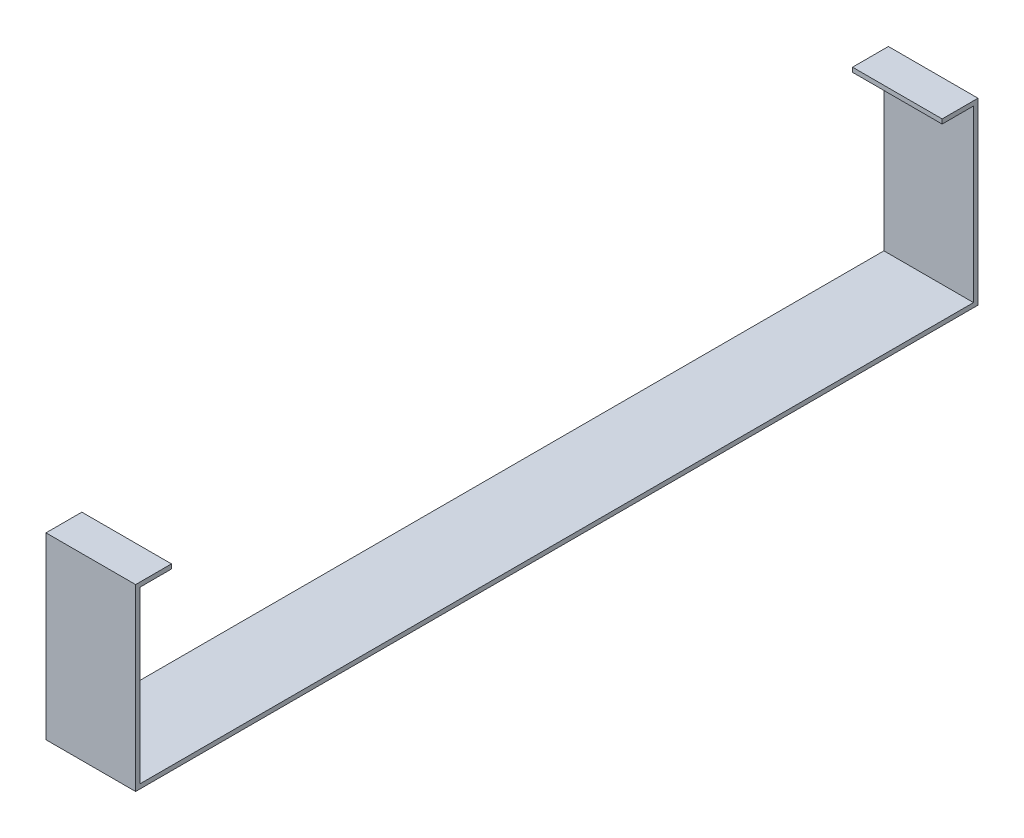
from build123d import *

# Parameters (mm, degrees)
BOSS_EXTRUDE1_DEPTH = 90


with BuildPart() as part:
    # Sketch1 → Boss-Extrude1 (new body)
    with BuildSketch(Plane(origin=(0, 0, 0), x_dir=(0, 0, -1), z_dir=(1, 0, 0))):
        Polygon((0, 0), (0, 180), (36, 180), (36, 175.5), (4.5, 175.5), (4.5, 4.5), (841.5, 4.5), (841.5, 175.5), (810, 175.5), (810, 180), (846, 180), (846, 0), align=None)
    extrude(amount=-BOSS_EXTRUDE1_DEPTH)


solid = part.part
